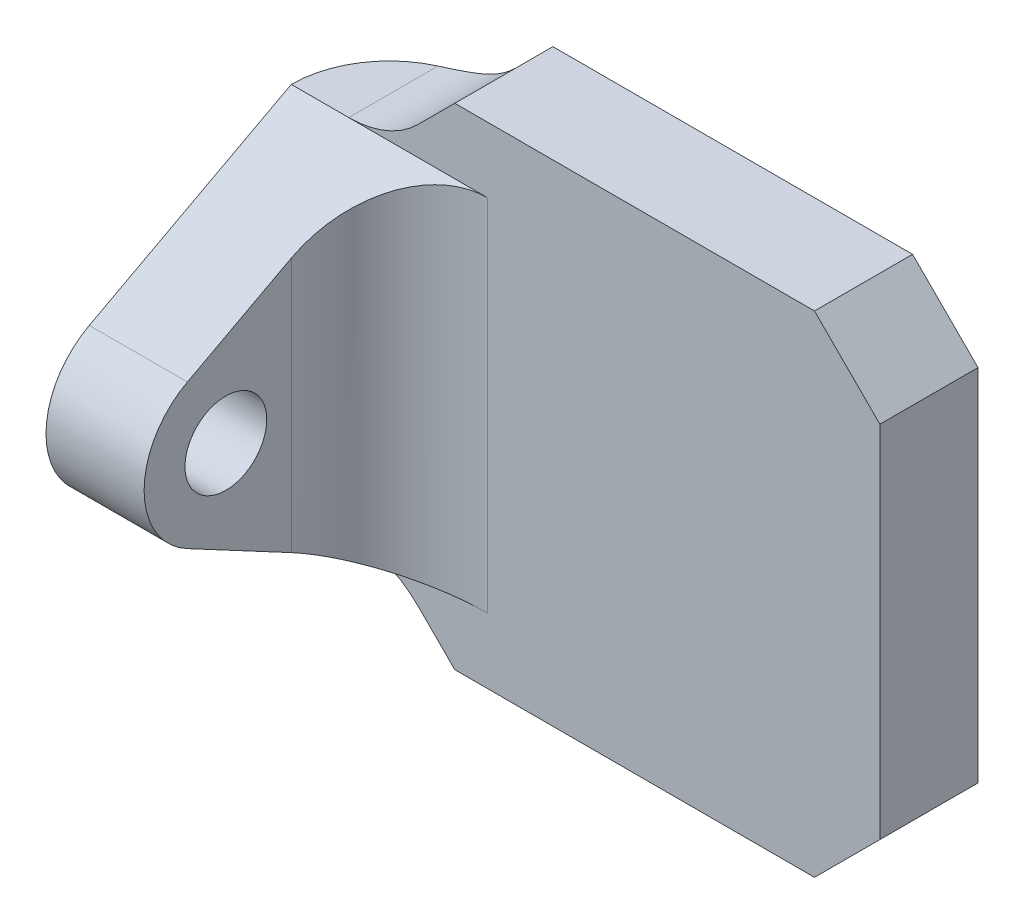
ISO-10303-21;
HEADER;
FILE_DESCRIPTION(('STEP AP214'),'2;1');
FILE_NAME('part.step','',(''),(''),'','','');
FILE_SCHEMA(('AUTOMOTIVE_DESIGN { 1 0 10303 214 1 1 1 1 }'));
ENDSEC;
DATA;
#1=APPLICATION_CONTEXT('core data for automotive mechanical design processes');
#2=APPLICATION_PROTOCOL_DEFINITION('international standard','automotive_design',2000,#1);
#3=PRODUCT_CONTEXT('',#1,'mechanical');
#4=PRODUCT('Part','Part','',(#3));
#5=PRODUCT_RELATED_PRODUCT_CATEGORY('part','',(#4));
#6=PRODUCT_DEFINITION_FORMATION('','',#4);
#7=PRODUCT_DEFINITION_CONTEXT('part definition',#1,'design');
#8=PRODUCT_DEFINITION('design','',#6,#7);
#9=PRODUCT_DEFINITION_SHAPE('','',#8);
#10=(LENGTH_UNIT() NAMED_UNIT(*) SI_UNIT(.MILLI.,.METRE.));
#11=(NAMED_UNIT(*) PLANE_ANGLE_UNIT() SI_UNIT($,.RADIAN.));
#12=(NAMED_UNIT(*) SI_UNIT($,.STERADIAN.) SOLID_ANGLE_UNIT());
#13=UNCERTAINTY_MEASURE_WITH_UNIT(LENGTH_MEASURE(1.E-05),#10,'distance_accuracy_value','');
#14=(GEOMETRIC_REPRESENTATION_CONTEXT(3) GLOBAL_UNCERTAINTY_ASSIGNED_CONTEXT((#13)) GLOBAL_UNIT_ASSIGNED_CONTEXT((#10,
#11,#12)) REPRESENTATION_CONTEXT('',''));
#15=CARTESIAN_POINT('',(0.,0.,0.));
#16=DIRECTION('',(0.,0.,1.));
#17=DIRECTION('',(1.,0.,0.));
#18=AXIS2_PLACEMENT_3D('',#15,#16,#17);
#19=CARTESIAN_POINT('',(-7.5,-7.5,3.));
#20=DIRECTION('',(0.,1.,0.));
#21=DIRECTION('',(0.,0.,1.));
#22=AXIS2_PLACEMENT_3D('',#19,#20,#21);
#23=PLANE('',#22);
#24=DIRECTION('',(1.,0.,0.));
#25=VECTOR('',#24,1.);
#26=CARTESIAN_POINT('',(-7.5,-7.5,3.));
#27=LINE('',#26,#25);
#28=CARTESIAN_POINT('',(-5.5,-7.5,3.));
#29=VERTEX_POINT('',#28);
#30=CARTESIAN_POINT('',(5.5,-7.5,3.));
#31=VERTEX_POINT('',#30);
#32=EDGE_CURVE('E223',#29,#31,#27,.T.);
#33=ORIENTED_EDGE('',*,*,#32,.F.);
#34=DIRECTION('',(0.,0.,-1.));
#35=VECTOR('',#34,1.);
#36=CARTESIAN_POINT('',(-5.5,-7.5,3.));
#37=LINE('',#36,#35);
#38=CARTESIAN_POINT('',(-5.5,-7.5,0.));
#39=VERTEX_POINT('',#38);
#40=EDGE_CURVE('E249',#29,#39,#37,.T.);
#41=ORIENTED_EDGE('',*,*,#40,.T.);
#42=DIRECTION('',(1.,0.,0.));
#43=VECTOR('',#42,1.);
#44=CARTESIAN_POINT('',(-7.5,-7.5,0.));
#45=LINE('',#44,#43);
#46=CARTESIAN_POINT('',(5.5,-7.5,0.));
#47=VERTEX_POINT('',#46);
#48=EDGE_CURVE('E187',#39,#47,#45,.T.);
#49=ORIENTED_EDGE('',*,*,#48,.T.);
#50=DIRECTION('',(0.,0.,1.));
#51=VECTOR('',#50,1.);
#52=CARTESIAN_POINT('',(5.5,-7.5,3.));
#53=LINE('',#52,#51);
#54=EDGE_CURVE('E236',#47,#31,#53,.T.);
#55=ORIENTED_EDGE('',*,*,#54,.T.);
#56=EDGE_LOOP('',(#33,#41,#49,#55));
#57=FACE_BOUND('',#56,.T.);
#58=ADVANCED_FACE('F41',(#57),#23,.F.);
#59=CARTESIAN_POINT('',(7.5,7.5,3.));
#60=DIRECTION('',(-1.,0.,0.));
#61=DIRECTION('',(0.,-1.,0.));
#62=AXIS2_PLACEMENT_3D('',#59,#60,#61);
#63=PLANE('',#62);
#64=DIRECTION('',(0.,1.,0.));
#65=VECTOR('',#64,1.);
#66=CARTESIAN_POINT('',(7.5,7.5,3.));
#67=LINE('',#66,#65);
#68=CARTESIAN_POINT('',(7.5,-5.5,3.));
#69=VERTEX_POINT('',#68);
#70=CARTESIAN_POINT('',(7.5,5.49999999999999,3.));
#71=VERTEX_POINT('',#70);
#72=EDGE_CURVE('E227',#69,#71,#67,.T.);
#73=ORIENTED_EDGE('',*,*,#72,.F.);
#74=DIRECTION('',(0.,0.,-1.));
#75=VECTOR('',#74,1.);
#76=CARTESIAN_POINT('',(7.5,-5.5,3.));
#77=LINE('',#76,#75);
#78=CARTESIAN_POINT('',(7.5,-5.5,0.));
#79=VERTEX_POINT('',#78);
#80=EDGE_CURVE('E282',#69,#79,#77,.T.);
#81=ORIENTED_EDGE('',*,*,#80,.T.);
#82=DIRECTION('',(0.,1.,0.));
#83=VECTOR('',#82,1.);
#84=CARTESIAN_POINT('',(7.5,7.5,0.));
#85=LINE('',#84,#83);
#86=CARTESIAN_POINT('',(7.5,5.49999999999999,0.));
#87=VERTEX_POINT('',#86);
#88=EDGE_CURVE('E240',#79,#87,#85,.T.);
#89=ORIENTED_EDGE('',*,*,#88,.T.);
#90=DIRECTION('',(0.,0.,1.));
#91=VECTOR('',#90,1.);
#92=CARTESIAN_POINT('',(7.5,5.49999999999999,3.));
#93=LINE('',#92,#91);
#94=EDGE_CURVE('E279',#87,#71,#93,.T.);
#95=ORIENTED_EDGE('',*,*,#94,.T.);
#96=EDGE_LOOP('',(#73,#81,#89,#95));
#97=FACE_BOUND('',#96,.T.);
#98=ADVANCED_FACE('F355',(#97),#63,.F.);
#99=CARTESIAN_POINT('',(-7.5,7.5,3.));
#100=DIRECTION('',(0.,-1.,0.));
#101=DIRECTION('',(0.,0.,-1.));
#102=AXIS2_PLACEMENT_3D('',#99,#100,#101);
#103=PLANE('',#102);
#104=DIRECTION('',(-1.,0.,0.));
#105=VECTOR('',#104,1.);
#106=CARTESIAN_POINT('',(-7.5,7.5,0.));
#107=LINE('',#106,#105);
#108=CARTESIAN_POINT('',(5.5,7.5,0.));
#109=VERTEX_POINT('',#108);
#110=CARTESIAN_POINT('',(-5.5,7.5,0.));
#111=VERTEX_POINT('',#110);
#112=EDGE_CURVE('E228',#109,#111,#107,.T.);
#113=ORIENTED_EDGE('',*,*,#112,.T.);
#114=DIRECTION('',(0.,0.,1.));
#115=VECTOR('',#114,1.);
#116=CARTESIAN_POINT('',(-5.5,7.5,3.));
#117=LINE('',#116,#115);
#118=CARTESIAN_POINT('',(-5.5,7.5,3.));
#119=VERTEX_POINT('',#118);
#120=EDGE_CURVE('E180',#111,#119,#117,.T.);
#121=ORIENTED_EDGE('',*,*,#120,.T.);
#122=DIRECTION('',(-1.,0.,0.));
#123=VECTOR('',#122,1.);
#124=CARTESIAN_POINT('',(-7.5,7.5,3.));
#125=LINE('',#124,#123);
#126=CARTESIAN_POINT('',(5.5,7.5,3.));
#127=VERTEX_POINT('',#126);
#128=EDGE_CURVE('E232',#127,#119,#125,.T.);
#129=ORIENTED_EDGE('',*,*,#128,.F.);
#130=DIRECTION('',(0.,0.,-1.));
#131=VECTOR('',#130,1.);
#132=CARTESIAN_POINT('',(5.5,7.5,3.));
#133=LINE('',#132,#131);
#134=EDGE_CURVE('E286',#127,#109,#133,.T.);
#135=ORIENTED_EDGE('',*,*,#134,.T.);
#136=EDGE_LOOP('',(#113,#121,#129,#135));
#137=FACE_BOUND('',#136,.T.);
#138=ADVANCED_FACE('F361',(#137),#103,.F.);
#139=CARTESIAN_POINT('',(0.,0.,3.));
#140=DIRECTION('',(0.,0.,1.));
#141=DIRECTION('',(1.,0.,0.));
#142=AXIS2_PLACEMENT_3D('',#139,#140,#141);
#143=PLANE('',#142);
#144=DIRECTION('',(0.,-1.,0.));
#145=VECTOR('',#144,1.);
#146=CARTESIAN_POINT('',(-4.5,0.,3.));
#147=LINE('',#146,#145);
#148=CARTESIAN_POINT('',(-4.5,5.5,3.));
#149=VERTEX_POINT('',#148);
#150=CARTESIAN_POINT('',(-4.5,-5.49999999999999,3.));
#151=VERTEX_POINT('',#150);
#152=EDGE_CURVE('E420',#149,#151,#147,.T.);
#153=ORIENTED_EDGE('',*,*,#152,.T.);
#154=DIRECTION('',(-1.,0.,0.));
#155=VECTOR('',#154,1.);
#156=CARTESIAN_POINT('',(0.,-5.49999999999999,3.));
#157=LINE('',#156,#155);
#158=CARTESIAN_POINT('',(-8.7426361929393,-5.49999999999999,3.));
#159=VERTEX_POINT('',#158);
#160=EDGE_CURVE('E417',#151,#159,#157,.T.);
#161=ORIENTED_EDGE('',*,*,#160,.T.);
#162=CARTESIAN_POINT('',(-8.74264068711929,-8.49999999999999,3.));
#163=DIRECTION('',(0.,0.,1.));
#164=DIRECTION('',(1.,0.,0.));
#165=AXIS2_PLACEMENT_3D('',#162,#163,#164);
#166=CIRCLE('',#165,3.);
#167=CARTESIAN_POINT('',(-6.62132034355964,-6.37867965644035,3.));
#168=VERTEX_POINT('',#167);
#169=EDGE_CURVE('E405',#159,#168,#166,.F.);
#170=ORIENTED_EDGE('',*,*,#169,.T.);
#171=DIRECTION('',(-0.707106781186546,0.707106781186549,0.));
#172=VECTOR('',#171,1.);
#173=CARTESIAN_POINT('',(-6.50000000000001,-6.49999999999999,3.));
#174=LINE('',#173,#172);
#175=EDGE_CURVE('E276',#168,#29,#174,.F.);
#176=ORIENTED_EDGE('',*,*,#175,.T.);
#177=ORIENTED_EDGE('',*,*,#32,.T.);
#178=DIRECTION('',(-0.707106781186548,-0.707106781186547,0.));
#179=VECTOR('',#178,1.);
#180=CARTESIAN_POINT('',(6.49999999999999,-6.50000000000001,3.));
#181=LINE('',#180,#179);
#182=EDGE_CURVE('E273',#31,#69,#181,.F.);
#183=ORIENTED_EDGE('',*,*,#182,.T.);
#184=ORIENTED_EDGE('',*,*,#72,.T.);
#185=DIRECTION('',(0.707106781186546,-0.707106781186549,0.));
#186=VECTOR('',#185,1.);
#187=CARTESIAN_POINT('',(6.50000000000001,6.49999999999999,3.));
#188=LINE('',#187,#186);
#189=EDGE_CURVE('E266',#71,#127,#188,.F.);
#190=ORIENTED_EDGE('',*,*,#189,.T.);
#191=ORIENTED_EDGE('',*,*,#128,.T.);
#192=DIRECTION('',(0.707106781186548,0.707106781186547,0.));
#193=VECTOR('',#192,1.);
#194=CARTESIAN_POINT('',(-6.49999999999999,6.50000000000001,3.));
#195=LINE('',#194,#193);
#196=CARTESIAN_POINT('',(-6.62132034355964,6.37867965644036,3.));
#197=VERTEX_POINT('',#196);
#198=EDGE_CURVE('E269',#119,#197,#195,.F.);
#199=ORIENTED_EDGE('',*,*,#198,.T.);
#200=CARTESIAN_POINT('',(-8.74264068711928,8.5,3.));
#201=DIRECTION('',(0.,0.,1.));
#202=DIRECTION('',(1.,0.,0.));
#203=AXIS2_PLACEMENT_3D('',#200,#201,#202);
#204=CIRCLE('',#203,3.);
#205=CARTESIAN_POINT('',(-8.74264068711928,5.5,3.));
#206=VERTEX_POINT('',#205);
#207=EDGE_CURVE('E401',#197,#206,#204,.F.);
#208=ORIENTED_EDGE('',*,*,#207,.T.);
#209=DIRECTION('',(-1.,0.,0.));
#210=VECTOR('',#209,1.);
#211=CARTESIAN_POINT('',(-10.5,5.5,3.));
#212=LINE('',#211,#210);
#213=EDGE_CURVE('E339',#149,#206,#212,.T.);
#214=ORIENTED_EDGE('',*,*,#213,.F.);
#215=EDGE_LOOP('',(#153,#161,#170,#176,#177,#183,#184,#190,#191,#199,#208,#214));
#216=FACE_BOUND('',#215,.T.);
#217=ADVANCED_FACE('F426',(#216),#143,.T.);
#218=CARTESIAN_POINT('',(0.,0.,0.));
#219=DIRECTION('',(0.,0.,1.));
#220=DIRECTION('',(1.,0.,0.));
#221=AXIS2_PLACEMENT_3D('',#218,#219,#220);
#222=PLANE('',#221);
#223=DIRECTION('',(0.707106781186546,-0.707106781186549,0.));
#224=VECTOR('',#223,1.);
#225=CARTESIAN_POINT('',(-5.5,-7.5,0.));
#226=LINE('',#225,#224);
#227=CARTESIAN_POINT('',(-6.62132034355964,-6.37867965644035,0.));
#228=VERTEX_POINT('',#227);
#229=EDGE_CURVE('E262',#39,#228,#226,.F.);
#230=ORIENTED_EDGE('',*,*,#229,.T.);
#231=CARTESIAN_POINT('',(-8.74264068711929,-8.49999999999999,0.));
#232=DIRECTION('',(0.,0.,1.));
#233=DIRECTION('',(1.,0.,0.));
#234=AXIS2_PLACEMENT_3D('',#231,#232,#233);
#235=CIRCLE('',#234,3.);
#236=CARTESIAN_POINT('',(-7.5,-5.76946083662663,0.));
#237=VERTEX_POINT('',#236);
#238=EDGE_CURVE('E340',#228,#237,#235,.T.);
#239=ORIENTED_EDGE('',*,*,#238,.T.);
#240=DIRECTION('',(0.,-1.,0.));
#241=VECTOR('',#240,1.);
#242=CARTESIAN_POINT('',(-7.5,5.5,0.));
#243=LINE('',#242,#241);
#244=CARTESIAN_POINT('',(-7.5,5.76946083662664,0.));
#245=VERTEX_POINT('',#244);
#246=EDGE_CURVE('E167',#237,#245,#243,.F.);
#247=ORIENTED_EDGE('',*,*,#246,.T.);
#248=CARTESIAN_POINT('',(-8.74264068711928,8.5,0.));
#249=DIRECTION('',(0.,0.,1.));
#250=DIRECTION('',(1.,0.,0.));
#251=AXIS2_PLACEMENT_3D('',#248,#249,#250);
#252=CIRCLE('',#251,3.);
#253=CARTESIAN_POINT('',(-6.62132034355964,6.37867965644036,0.));
#254=VERTEX_POINT('',#253);
#255=EDGE_CURVE('E319',#245,#254,#252,.T.);
#256=ORIENTED_EDGE('',*,*,#255,.T.);
#257=DIRECTION('',(-0.707106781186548,-0.707106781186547,0.));
#258=VECTOR('',#257,1.);
#259=CARTESIAN_POINT('',(-7.5,5.5,0.));
#260=LINE('',#259,#258);
#261=EDGE_CURVE('E256',#254,#111,#260,.F.);
#262=ORIENTED_EDGE('',*,*,#261,.T.);
#263=ORIENTED_EDGE('',*,*,#112,.F.);
#264=DIRECTION('',(-0.707106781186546,0.707106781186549,0.));
#265=VECTOR('',#264,1.);
#266=CARTESIAN_POINT('',(5.5,7.5,0.));
#267=LINE('',#266,#265);
#268=EDGE_CURVE('E253',#109,#87,#267,.F.);
#269=ORIENTED_EDGE('',*,*,#268,.T.);
#270=ORIENTED_EDGE('',*,*,#88,.F.);
#271=DIRECTION('',(0.707106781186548,0.707106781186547,0.));
#272=VECTOR('',#271,1.);
#273=CARTESIAN_POINT('',(7.5,-5.5,0.));
#274=LINE('',#273,#272);
#275=EDGE_CURVE('E259',#79,#47,#274,.F.);
#276=ORIENTED_EDGE('',*,*,#275,.T.);
#277=ORIENTED_EDGE('',*,*,#48,.F.);
#278=EDGE_LOOP('',(#230,#239,#247,#256,#262,#263,#269,#270,#276,#277));
#279=FACE_BOUND('',#278,.T.);
#280=ADVANCED_FACE('F375',(#279),#222,.F.);
#281=CARTESIAN_POINT('',(-5.5,-7.5,3.));
#282=DIRECTION('',(0.707106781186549,0.707106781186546,0.));
#283=DIRECTION('',(0.,0.,-1.));
#284=AXIS2_PLACEMENT_3D('',#281,#282,#283);
#285=PLANE('',#284);
#286=ORIENTED_EDGE('',*,*,#175,.F.);
#287=DIRECTION('',(0.,0.,1.));
#288=VECTOR('',#287,1.);
#289=CARTESIAN_POINT('',(-6.62132034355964,-6.37867965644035,3.));
#290=LINE('',#289,#288);
#291=EDGE_CURVE('E306',#168,#228,#290,.F.);
#292=ORIENTED_EDGE('',*,*,#291,.T.);
#293=ORIENTED_EDGE('',*,*,#229,.F.);
#294=ORIENTED_EDGE('',*,*,#40,.F.);
#295=EDGE_LOOP('',(#286,#292,#293,#294));
#296=FACE_BOUND('',#295,.T.);
#297=ADVANCED_FACE('F368',(#296),#285,.F.);
#298=CARTESIAN_POINT('',(7.5,-5.5,3.));
#299=DIRECTION('',(-0.707106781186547,0.707106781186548,0.));
#300=DIRECTION('',(0.,0.,-1.));
#301=AXIS2_PLACEMENT_3D('',#298,#299,#300);
#302=PLANE('',#301);
#303=ORIENTED_EDGE('',*,*,#182,.F.);
#304=ORIENTED_EDGE('',*,*,#54,.F.);
#305=ORIENTED_EDGE('',*,*,#275,.F.);
#306=ORIENTED_EDGE('',*,*,#80,.F.);
#307=EDGE_LOOP('',(#303,#304,#305,#306));
#308=FACE_BOUND('',#307,.T.);
#309=ADVANCED_FACE('F374',(#308),#302,.F.);
#310=CARTESIAN_POINT('',(-7.5,5.5,3.));
#311=DIRECTION('',(0.707106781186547,-0.707106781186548,0.));
#312=DIRECTION('',(0.,0.,-1.));
#313=AXIS2_PLACEMENT_3D('',#310,#311,#312);
#314=PLANE('',#313);
#315=ORIENTED_EDGE('',*,*,#261,.F.);
#316=DIRECTION('',(0.,0.,-1.));
#317=VECTOR('',#316,1.);
#318=CARTESIAN_POINT('',(-6.62132034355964,6.37867965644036,3.));
#319=LINE('',#318,#317);
#320=EDGE_CURVE('E301',#254,#197,#319,.F.);
#321=ORIENTED_EDGE('',*,*,#320,.T.);
#322=ORIENTED_EDGE('',*,*,#198,.F.);
#323=ORIENTED_EDGE('',*,*,#120,.F.);
#324=EDGE_LOOP('',(#315,#321,#322,#323));
#325=FACE_BOUND('',#324,.T.);
#326=ADVANCED_FACE('F381',(#325),#314,.F.);
#327=CARTESIAN_POINT('',(5.5,7.5,3.));
#328=DIRECTION('',(-0.707106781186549,-0.707106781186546,0.));
#329=DIRECTION('',(0.,0.,-1.));
#330=AXIS2_PLACEMENT_3D('',#327,#328,#329);
#331=PLANE('',#330);
#332=ORIENTED_EDGE('',*,*,#189,.F.);
#333=ORIENTED_EDGE('',*,*,#94,.F.);
#334=ORIENTED_EDGE('',*,*,#268,.F.);
#335=ORIENTED_EDGE('',*,*,#134,.F.);
#336=EDGE_LOOP('',(#332,#333,#334,#335));
#337=FACE_BOUND('',#336,.T.);
#338=ADVANCED_FACE('F328',(#337),#331,.F.);
#339=CARTESIAN_POINT('',(-10.5,0.,8.));
#340=DIRECTION('',(-1.,0.,0.));
#341=DIRECTION('',(0.,-1.,0.));
#342=AXIS2_PLACEMENT_3D('',#339,#340,#341);
#343=PLANE('',#342);
#344=DIRECTION('',(0.,0.470588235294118,-0.882352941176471));
#345=VECTOR('',#344,1.);
#346=CARTESIAN_POINT('',(-10.5,2.20588235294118,9.1764705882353));
#347=LINE('',#346,#345);
#348=CARTESIAN_POINT('',(-10.5,2.20588235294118,9.1764705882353));
#349=VERTEX_POINT('',#348);
#350=CARTESIAN_POINT('',(-10.5,5.5,3.));
#351=VERTEX_POINT('',#350);
#352=EDGE_CURVE('E177',#349,#351,#347,.T.);
#353=ORIENTED_EDGE('',*,*,#352,.T.);
#354=DIRECTION('',(0.,-1.,0.));
#355=VECTOR('',#354,1.);
#356=CARTESIAN_POINT('',(-10.5,-5.49999999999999,3.));
#357=LINE('',#356,#355);
#358=CARTESIAN_POINT('',(-10.5,-5.49999999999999,3.));
#359=VERTEX_POINT('',#358);
#360=EDGE_CURVE('E159',#351,#359,#357,.T.);
#361=ORIENTED_EDGE('',*,*,#360,.T.);
#362=DIRECTION('',(0.,0.470588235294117,0.882352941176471));
#363=VECTOR('',#362,1.);
#364=CARTESIAN_POINT('',(-10.5,-2.20588235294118,9.17647058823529));
#365=LINE('',#364,#363);
#366=CARTESIAN_POINT('',(-10.5,-2.20588235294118,9.17647058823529));
#367=VERTEX_POINT('',#366);
#368=EDGE_CURVE('E174',#359,#367,#365,.T.);
#369=ORIENTED_EDGE('',*,*,#368,.T.);
#370=CARTESIAN_POINT('',(-10.5,0.,8.));
#371=DIRECTION('',(-1.,0.,0.));
#372=DIRECTION('',(0.,-1.,0.));
#373=AXIS2_PLACEMENT_3D('',#370,#371,#372);
#374=CIRCLE('',#373,2.5);
#375=EDGE_CURVE('E194',#367,#349,#374,.T.);
#376=ORIENTED_EDGE('',*,*,#375,.T.);
#377=EDGE_LOOP('',(#353,#361,#369,#376));
#378=FACE_BOUND('',#377,.T.);
#379=CARTESIAN_POINT('',(-10.5,0.,8.));
#380=DIRECTION('',(-1.,0.,0.));
#381=DIRECTION('',(0.,-1.,0.));
#382=AXIS2_PLACEMENT_3D('',#379,#380,#381);
#383=CIRCLE('',#382,1.25);
#384=CARTESIAN_POINT('',(-10.5,-1.25,8.));
#385=VERTEX_POINT('',#384);
#386=EDGE_CURVE('E212',#385,#385,#383,.T.);
#387=ORIENTED_EDGE('',*,*,#386,.F.);
#388=EDGE_LOOP('',(#387));
#389=FACE_BOUND('',#388,.T.);
#390=ADVANCED_FACE('F171',(#378,#389),#343,.T.);
#391=CARTESIAN_POINT('',(-7.5,0.,8.));
#392=DIRECTION('',(-1.,0.,0.));
#393=DIRECTION('',(0.,-1.,0.));
#394=AXIS2_PLACEMENT_3D('',#391,#392,#393);
#395=PLANE('',#394);
#396=DIRECTION('',(0.,0.470588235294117,0.882352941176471));
#397=VECTOR('',#396,1.);
#398=CARTESIAN_POINT('',(-7.5,-2.20588235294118,9.17647058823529));
#399=LINE('',#398,#397);
#400=CARTESIAN_POINT('',(-7.5,-3.9,6.));
#401=VERTEX_POINT('',#400);
#402=CARTESIAN_POINT('',(-7.5,-2.20588235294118,9.17647058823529));
#403=VERTEX_POINT('',#402);
#404=EDGE_CURVE('E209',#401,#403,#399,.T.);
#405=ORIENTED_EDGE('',*,*,#404,.F.);
#406=DIRECTION('',(0.,-1.,0.));
#407=VECTOR('',#406,1.);
#408=CARTESIAN_POINT('',(-7.5,0.,6.));
#409=LINE('',#408,#407);
#410=CARTESIAN_POINT('',(-7.5,3.9,6.));
#411=VERTEX_POINT('',#410);
#412=EDGE_CURVE('E63',#401,#411,#409,.F.);
#413=ORIENTED_EDGE('',*,*,#412,.T.);
#414=DIRECTION('',(0.,0.470588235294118,-0.882352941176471));
#415=VECTOR('',#414,1.);
#416=CARTESIAN_POINT('',(-7.5,2.20588235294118,9.1764705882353));
#417=LINE('',#416,#415);
#418=CARTESIAN_POINT('',(-7.5,2.20588235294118,9.1764705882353));
#419=VERTEX_POINT('',#418);
#420=EDGE_CURVE('E195',#419,#411,#417,.T.);
#421=ORIENTED_EDGE('',*,*,#420,.F.);
#422=CARTESIAN_POINT('',(-7.5,0.,8.));
#423=DIRECTION('',(-1.,0.,0.));
#424=DIRECTION('',(0.,-1.,0.));
#425=AXIS2_PLACEMENT_3D('',#422,#423,#424);
#426=CIRCLE('',#425,2.5);
#427=EDGE_CURVE('E200',#403,#419,#426,.T.);
#428=ORIENTED_EDGE('',*,*,#427,.F.);
#429=EDGE_LOOP('',(#405,#413,#421,#428));
#430=FACE_BOUND('',#429,.T.);
#431=CARTESIAN_POINT('',(-7.5,0.,8.));
#432=DIRECTION('',(-1.,0.,0.));
#433=DIRECTION('',(0.,-1.,0.));
#434=AXIS2_PLACEMENT_3D('',#431,#432,#433);
#435=CIRCLE('',#434,1.25);
#436=CARTESIAN_POINT('',(-7.5,-1.25,8.));
#437=VERTEX_POINT('',#436);
#438=EDGE_CURVE('E203',#437,#437,#435,.T.);
#439=ORIENTED_EDGE('',*,*,#438,.T.);
#440=EDGE_LOOP('',(#439));
#441=FACE_BOUND('',#440,.T.);
#442=ADVANCED_FACE('F438',(#430,#441),#395,.F.);
#443=CARTESIAN_POINT('',(-10.5,-5.49999999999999,3.));
#444=DIRECTION('',(0.,1.,0.));
#445=DIRECTION('',(-1.,0.,0.));
#446=AXIS2_PLACEMENT_3D('',#443,#444,#445);
#447=PLANE('',#446);
#448=CARTESIAN_POINT('',(-7.5,-5.49999999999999,3.));
#449=DIRECTION('',(0.,1.,0.));
#450=DIRECTION('',(-1.,0.,0.));
#451=AXIS2_PLACEMENT_3D('',#448,#449,#450);
#452=CIRCLE('',#451,3.);
#453=CARTESIAN_POINT('',(-8.74264068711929,-5.49999999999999,0.269460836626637));
#454=VERTEX_POINT('',#453);
#455=EDGE_CURVE('E155',#359,#454,#452,.F.);
#456=ORIENTED_EDGE('',*,*,#455,.T.);
#457=DIRECTION('',(0.,0.,-1.));
#458=VECTOR('',#457,1.);
#459=CARTESIAN_POINT('',(-8.74264068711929,-5.49999999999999,3.));
#460=LINE('',#459,#458);
#461=EDGE_CURVE('E185',#454,#159,#460,.F.);
#462=ORIENTED_EDGE('',*,*,#461,.T.);
#463=DIRECTION('',(1.,0.,0.));
#464=VECTOR('',#463,1.);
#465=CARTESIAN_POINT('',(-10.5,-5.49999999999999,3.));
#466=LINE('',#465,#464);
#467=EDGE_CURVE('E183',#359,#159,#466,.T.);
#468=ORIENTED_EDGE('',*,*,#467,.F.);
#469=EDGE_LOOP('',(#456,#462,#468));
#470=FACE_BOUND('',#469,.T.);
#471=ADVANCED_FACE('F184',(#470),#447,.F.);
#472=CARTESIAN_POINT('',(-10.5,-2.20588235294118,9.17647058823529));
#473=DIRECTION('',(0.,0.882352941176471,-0.470588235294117));
#474=DIRECTION('',(0.,0.470588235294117,0.882352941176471));
#475=AXIS2_PLACEMENT_3D('',#472,#473,#474);
#476=PLANE('',#475);
#477=ORIENTED_EDGE('',*,*,#160,.F.);
#478=CARTESIAN_POINT('',(-4.5,-3.9,6.));
#479=DIRECTION('',(0.,0.882352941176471,-0.470588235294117));
#480=DIRECTION('',(0.,-0.470588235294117,-0.882352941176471));
#481=AXIS2_PLACEMENT_3D('',#478,#479,#480);
#482=ELLIPSE('',#481,3.4,3.);
#483=EDGE_CURVE('E50',#151,#401,#482,.T.);
#484=ORIENTED_EDGE('',*,*,#483,.T.);
#485=ORIENTED_EDGE('',*,*,#404,.T.);
#486=DIRECTION('',(1.,0.,0.));
#487=VECTOR('',#486,1.);
#488=CARTESIAN_POINT('',(-10.5,-2.20588235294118,9.17647058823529));
#489=LINE('',#488,#487);
#490=EDGE_CURVE('E188',#367,#403,#489,.T.);
#491=ORIENTED_EDGE('',*,*,#490,.F.);
#492=ORIENTED_EDGE('',*,*,#368,.F.);
#493=ORIENTED_EDGE('',*,*,#467,.T.);
#494=EDGE_LOOP('',(#477,#484,#485,#491,#492,#493));
#495=FACE_BOUND('',#494,.T.);
#496=ADVANCED_FACE('F190',(#495),#476,.F.);
#497=CARTESIAN_POINT('',(-10.5,0.,8.));
#498=DIRECTION('',(1.,0.,0.));
#499=DIRECTION('',(0.,1.,0.));
#500=AXIS2_PLACEMENT_3D('',#497,#498,#499);
#501=CYLINDRICAL_SURFACE('',#500,2.5);
#502=ORIENTED_EDGE('',*,*,#427,.T.);
#503=DIRECTION('',(1.,0.,0.));
#504=VECTOR('',#503,1.);
#505=CARTESIAN_POINT('',(-10.5,2.20588235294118,9.1764705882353));
#506=LINE('',#505,#504);
#507=EDGE_CURVE('E217',#349,#419,#506,.T.);
#508=ORIENTED_EDGE('',*,*,#507,.F.);
#509=ORIENTED_EDGE('',*,*,#375,.F.);
#510=ORIENTED_EDGE('',*,*,#490,.T.);
#511=EDGE_LOOP('',(#502,#508,#509,#510));
#512=FACE_BOUND('',#511,.T.);
#513=ADVANCED_FACE('F441',(#512),#501,.T.);
#514=CARTESIAN_POINT('',(-10.5,2.20588235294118,9.1764705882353));
#515=DIRECTION('',(0.,-0.882352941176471,-0.470588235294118));
#516=DIRECTION('',(0.,0.470588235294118,-0.882352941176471));
#517=AXIS2_PLACEMENT_3D('',#514,#515,#516);
#518=PLANE('',#517);
#519=ORIENTED_EDGE('',*,*,#420,.T.);
#520=CARTESIAN_POINT('',(-4.5,3.9,6.));
#521=DIRECTION('',(0.,-0.882352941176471,-0.470588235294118));
#522=DIRECTION('',(0.,-0.470588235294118,0.882352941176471));
#523=AXIS2_PLACEMENT_3D('',#520,#521,#522);
#524=ELLIPSE('',#523,3.4,3.);
#525=EDGE_CURVE('E11',#411,#149,#524,.T.);
#526=ORIENTED_EDGE('',*,*,#525,.T.);
#527=ORIENTED_EDGE('',*,*,#213,.T.);
#528=DIRECTION('',(1.,0.,0.));
#529=VECTOR('',#528,1.);
#530=CARTESIAN_POINT('',(-10.5,5.5,3.));
#531=LINE('',#530,#529);
#532=EDGE_CURVE('E208',#351,#206,#531,.T.);
#533=ORIENTED_EDGE('',*,*,#532,.F.);
#534=ORIENTED_EDGE('',*,*,#352,.F.);
#535=ORIENTED_EDGE('',*,*,#507,.T.);
#536=EDGE_LOOP('',(#519,#526,#527,#533,#534,#535));
#537=FACE_BOUND('',#536,.T.);
#538=ADVANCED_FACE('F412',(#537),#518,.F.);
#539=CARTESIAN_POINT('',(-10.5,5.5,3.));
#540=DIRECTION('',(0.,-1.,0.));
#541=DIRECTION('',(1.,0.,0.));
#542=AXIS2_PLACEMENT_3D('',#539,#540,#541);
#543=PLANE('',#542);
#544=ORIENTED_EDGE('',*,*,#532,.T.);
#545=DIRECTION('',(0.,0.,1.));
#546=VECTOR('',#545,1.);
#547=CARTESIAN_POINT('',(-8.74264068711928,5.5,3.));
#548=LINE('',#547,#546);
#549=CARTESIAN_POINT('',(-8.74264068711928,5.5,0.269460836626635));
#550=VERTEX_POINT('',#549);
#551=EDGE_CURVE('E297',#206,#550,#548,.F.);
#552=ORIENTED_EDGE('',*,*,#551,.T.);
#553=CARTESIAN_POINT('',(-7.5,5.5,3.));
#554=DIRECTION('',(0.,-1.,0.));
#555=DIRECTION('',(1.,0.,0.));
#556=AXIS2_PLACEMENT_3D('',#553,#554,#555);
#557=CIRCLE('',#556,3.);
#558=EDGE_CURVE('E294',#550,#351,#557,.F.);
#559=ORIENTED_EDGE('',*,*,#558,.T.);
#560=EDGE_LOOP('',(#544,#552,#559));
#561=FACE_BOUND('',#560,.T.);
#562=ADVANCED_FACE('F410',(#561),#543,.F.);
#563=CARTESIAN_POINT('',(-10.5,0.,8.));
#564=DIRECTION('',(1.,0.,0.));
#565=DIRECTION('',(0.,1.,0.));
#566=AXIS2_PLACEMENT_3D('',#563,#564,#565);
#567=CYLINDRICAL_SURFACE('',#566,1.25);
#568=ORIENTED_EDGE('',*,*,#386,.T.);
#569=EDGE_LOOP('',(#568));
#570=FACE_BOUND('',#569,.T.);
#571=ORIENTED_EDGE('',*,*,#438,.F.);
#572=EDGE_LOOP('',(#571));
#573=FACE_BOUND('',#572,.T.);
#574=ADVANCED_FACE('F326',(#570,#573),#567,.F.);
#575=CARTESIAN_POINT('',(-7.5,0.,3.));
#576=DIRECTION('',(0.,1.,0.));
#577=DIRECTION('',(-1.,0.,0.));
#578=AXIS2_PLACEMENT_3D('',#575,#576,#577);
#579=CYLINDRICAL_SURFACE('',#578,3.);
#580=ORIENTED_EDGE('',*,*,#558,.F.);
#581=CARTESIAN_POINT('',(-8.74264068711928,5.5,0.269460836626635));
#582=CARTESIAN_POINT('',(-8.68523367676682,5.4999891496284,0.24332181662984));
#583=CARTESIAN_POINT('',(-8.62698273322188,5.50164764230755,0.219011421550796));
#584=CARTESIAN_POINT('',(-8.5092309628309,5.50851498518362,0.174154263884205));
#585=CARTESIAN_POINT('',(-8.44972968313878,5.51372514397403,0.153608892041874));
#586=CARTESIAN_POINT('',(-8.33145311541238,5.52773079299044,0.116871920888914));
#587=CARTESIAN_POINT('',(-8.27269678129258,5.53643353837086,0.100584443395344));
#588=CARTESIAN_POINT('',(-8.15496330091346,5.55751556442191,0.0717413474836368));
#589=CARTESIAN_POINT('',(-8.09598624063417,5.56989353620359,0.0591844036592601));
#590=CARTESIAN_POINT('',(-7.94678958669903,5.60600079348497,0.0320404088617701));
#591=CARTESIAN_POINT('',(-7.85669614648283,5.63226249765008,0.0199471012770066));
#592=CARTESIAN_POINT('',(-7.7224288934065,5.67839067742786,0.00790876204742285));
#593=CARTESIAN_POINT('',(-7.6773823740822,5.69508698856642,0.00491470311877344));
#594=CARTESIAN_POINT('',(-7.58806759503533,5.73065534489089,0.000960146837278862));
#595=CARTESIAN_POINT('',(-7.54379929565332,5.74952727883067,-4.54443781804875E-07));
#596=CARTESIAN_POINT('',(-7.5,5.76946083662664,0.));
#597=B_SPLINE_CURVE_WITH_KNOTS('',3,(#581,#582,#583,#584,#585,#586,#587,#588,#589,#590,#591,
#592,#593,#594,#595,#596),.UNSPECIFIED.,.F.,.F.,(4,2,2,2,2,2,2,4),(0.,0.189194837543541,
0.378459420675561,0.562999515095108,0.747473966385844,1.03041128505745,1.17473285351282,
1.31904704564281),.UNSPECIFIED.);
#598=EDGE_CURVE('E309',#550,#245,#597,.T.);
#599=ORIENTED_EDGE('',*,*,#598,.T.);
#600=ORIENTED_EDGE('',*,*,#246,.F.);
#601=CARTESIAN_POINT('',(-7.5,-5.76946083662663,0.));
#602=CARTESIAN_POINT('',(-7.55740701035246,-5.74332181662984,-1.08503715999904E-05));
#603=CARTESIAN_POINT('',(-7.6156579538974,-5.71901142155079,0.00164764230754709));
#604=CARTESIAN_POINT('',(-7.73340972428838,-5.6741542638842,0.00851498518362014));
#605=CARTESIAN_POINT('',(-7.79291100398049,-5.65360889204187,0.013725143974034));
#606=CARTESIAN_POINT('',(-7.9111875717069,-5.61687192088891,0.0277307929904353));
#607=CARTESIAN_POINT('',(-7.9699439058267,-5.60058444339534,0.0364335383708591));
#608=CARTESIAN_POINT('',(-8.08767738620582,-5.57174134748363,0.0575155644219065));
#609=CARTESIAN_POINT('',(-8.14665444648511,-5.55918440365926,0.0698935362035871));
#610=CARTESIAN_POINT('',(-8.29585110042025,-5.53204040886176,0.106000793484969));
#611=CARTESIAN_POINT('',(-8.38594454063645,-5.519947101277,0.132262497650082));
#612=CARTESIAN_POINT('',(-8.52021179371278,-5.50790876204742,0.178390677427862));
#613=CARTESIAN_POINT('',(-8.56525831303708,-5.50491470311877,0.19508698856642));
#614=CARTESIAN_POINT('',(-8.65457309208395,-5.50096014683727,0.230655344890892));
#615=CARTESIAN_POINT('',(-8.69884139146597,-5.49999954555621,0.24952727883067));
#616=CARTESIAN_POINT('',(-8.74264068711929,-5.49999999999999,0.269460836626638));
#617=B_SPLINE_CURVE_WITH_KNOTS('',3,(#601,#602,#603,#604,#605,#606,#607,#608,#609,#610,#611,
#612,#613,#614,#615,#616),.UNSPECIFIED.,.F.,.F.,(4,2,2,2,2,2,2,4),(0.,0.189194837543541,
0.378459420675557,0.562999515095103,0.747473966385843,1.03041128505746,1.17473285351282,
1.31904704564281),.UNSPECIFIED.);
#618=EDGE_CURVE('E161',#237,#454,#617,.T.);
#619=ORIENTED_EDGE('',*,*,#618,.T.);
#620=ORIENTED_EDGE('',*,*,#455,.F.);
#621=ORIENTED_EDGE('',*,*,#360,.F.);
#622=EDGE_LOOP('',(#580,#599,#600,#619,#620,#621));
#623=FACE_BOUND('',#622,.T.);
#624=ADVANCED_FACE('F158',(#623),#579,.T.);
#625=CARTESIAN_POINT('',(-8.74264068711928,8.5,3.));
#626=DIRECTION('',(0.,0.,1.));
#627=DIRECTION('',(1.,0.,0.));
#628=AXIS2_PLACEMENT_3D('',#625,#626,#627);
#629=CYLINDRICAL_SURFACE('',#628,3.);
#630=ORIENTED_EDGE('',*,*,#207,.F.);
#631=ORIENTED_EDGE('',*,*,#320,.F.);
#632=ORIENTED_EDGE('',*,*,#255,.F.);
#633=ORIENTED_EDGE('',*,*,#598,.F.);
#634=ORIENTED_EDGE('',*,*,#551,.F.);
#635=EDGE_LOOP('',(#630,#631,#632,#633,#634));
#636=FACE_BOUND('',#635,.T.);
#637=ADVANCED_FACE('F321',(#636),#629,.F.);
#638=CARTESIAN_POINT('',(-8.74264068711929,-8.49999999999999,3.));
#639=DIRECTION('',(0.,0.,-1.));
#640=DIRECTION('',(-1.,0.,0.));
#641=AXIS2_PLACEMENT_3D('',#638,#639,#640);
#642=CYLINDRICAL_SURFACE('',#641,3.);
#643=ORIENTED_EDGE('',*,*,#238,.F.);
#644=ORIENTED_EDGE('',*,*,#291,.F.);
#645=ORIENTED_EDGE('',*,*,#169,.F.);
#646=ORIENTED_EDGE('',*,*,#461,.F.);
#647=ORIENTED_EDGE('',*,*,#618,.F.);
#648=EDGE_LOOP('',(#643,#644,#645,#646,#647));
#649=FACE_BOUND('',#648,.T.);
#650=ADVANCED_FACE('F343',(#649),#642,.F.);
#651=CARTESIAN_POINT('',(-4.5,0.,6.));
#652=DIRECTION('',(0.,-1.,0.));
#653=DIRECTION('',(1.,0.,0.));
#654=AXIS2_PLACEMENT_3D('',#651,#652,#653);
#655=CYLINDRICAL_SURFACE('',#654,3.);
#656=ORIENTED_EDGE('',*,*,#525,.F.);
#657=ORIENTED_EDGE('',*,*,#412,.F.);
#658=ORIENTED_EDGE('',*,*,#483,.F.);
#659=ORIENTED_EDGE('',*,*,#152,.F.);
#660=EDGE_LOOP('',(#656,#657,#658,#659));
#661=FACE_BOUND('',#660,.T.);
#662=ADVANCED_FACE('F43',(#661),#655,.F.);
#663=CLOSED_SHELL('',(#58,#98,#138,#217,#280,#297,#309,#326,#338,#390,#442,#471,#496,#513,#538,
#562,#574,#624,#637,#650,#662));
#664=MANIFOLD_SOLID_BREP('B2',#663);
#665=ADVANCED_BREP_SHAPE_REPRESENTATION('',(#18,#664),#14);
#666=SHAPE_DEFINITION_REPRESENTATION(#9,#665);
ENDSEC;
END-ISO-10303-21;
